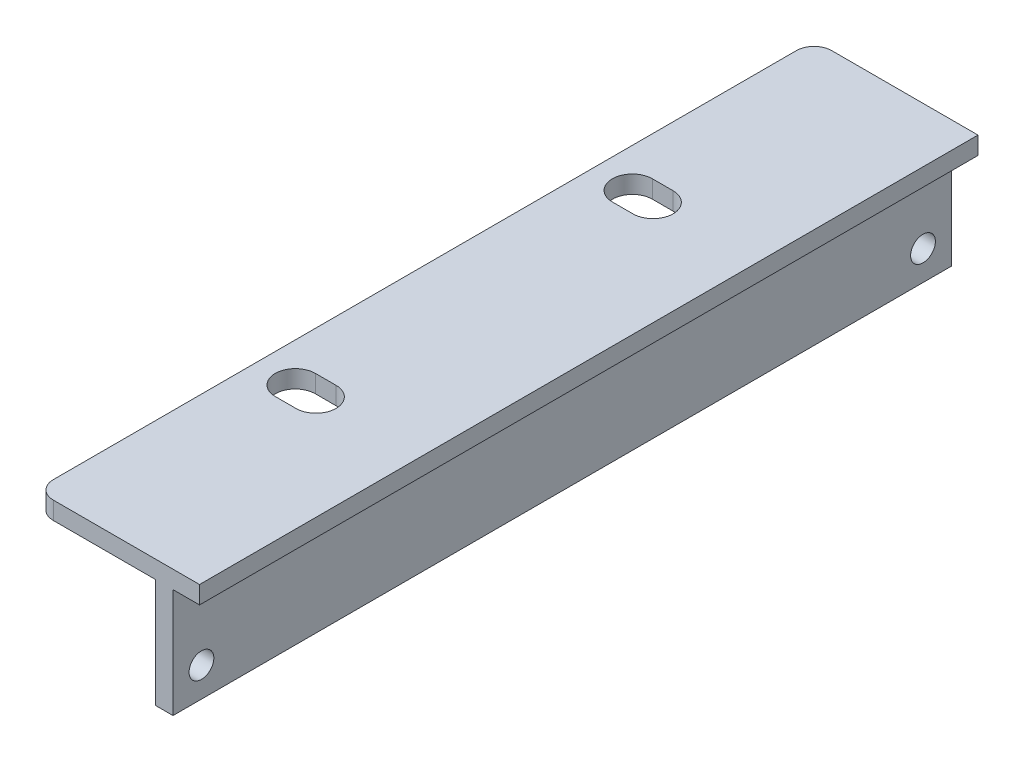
ISO-10303-21;
HEADER;
FILE_DESCRIPTION(('STEP AP214'),'2;1');
FILE_NAME('part.step','',(''),(''),'','','');
FILE_SCHEMA(('AUTOMOTIVE_DESIGN { 1 0 10303 214 1 1 1 1 }'));
ENDSEC;
DATA;
#1=APPLICATION_CONTEXT('core data for automotive mechanical design processes');
#2=APPLICATION_PROTOCOL_DEFINITION('international standard','automotive_design',2000,#1);
#3=PRODUCT_CONTEXT('',#1,'mechanical');
#4=PRODUCT('Part','Part','',(#3));
#5=PRODUCT_RELATED_PRODUCT_CATEGORY('part','',(#4));
#6=PRODUCT_DEFINITION_FORMATION('','',#4);
#7=PRODUCT_DEFINITION_CONTEXT('part definition',#1,'design');
#8=PRODUCT_DEFINITION('design','',#6,#7);
#9=PRODUCT_DEFINITION_SHAPE('','',#8);
#10=(LENGTH_UNIT() NAMED_UNIT(*) SI_UNIT(.MILLI.,.METRE.));
#11=(NAMED_UNIT(*) PLANE_ANGLE_UNIT() SI_UNIT($,.RADIAN.));
#12=(NAMED_UNIT(*) SI_UNIT($,.STERADIAN.) SOLID_ANGLE_UNIT());
#13=UNCERTAINTY_MEASURE_WITH_UNIT(LENGTH_MEASURE(1.E-05),#10,'distance_accuracy_value','');
#14=(GEOMETRIC_REPRESENTATION_CONTEXT(3) GLOBAL_UNCERTAINTY_ASSIGNED_CONTEXT((#13)) GLOBAL_UNIT_ASSIGNED_CONTEXT((#10,
#11,#12)) REPRESENTATION_CONTEXT('',''));
#15=CARTESIAN_POINT('',(0.,0.,0.));
#16=DIRECTION('',(0.,0.,1.));
#17=DIRECTION('',(1.,0.,0.));
#18=AXIS2_PLACEMENT_3D('',#15,#16,#17);
#19=CARTESIAN_POINT('',(0.00100000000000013,-16.5,-4.825));
#20=DIRECTION('',(-1.,0.,0.));
#21=DIRECTION('',(0.,0.,1.));
#22=AXIS2_PLACEMENT_3D('',#19,#20,#21);
#23=CYLINDRICAL_SURFACE('',#22,2.1);
#24=CARTESIAN_POINT('',(-7.50000000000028,-16.5,-4.825));
#25=DIRECTION('',(-1.,0.,0.));
#26=DIRECTION('',(0.,0.,1.));
#27=AXIS2_PLACEMENT_3D('',#24,#25,#26);
#28=CIRCLE('',#27,2.1);
#29=CARTESIAN_POINT('',(-7.50000000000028,-16.5,-2.72499999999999));
#30=VERTEX_POINT('',#29);
#31=EDGE_CURVE('E205',#30,#30,#28,.F.);
#32=ORIENTED_EDGE('',*,*,#31,.F.);
#33=EDGE_LOOP('',(#32));
#34=FACE_BOUND('',#33,.T.);
#35=CARTESIAN_POINT('',(-4.50000000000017,-16.5,-4.825));
#36=DIRECTION('',(-1.,0.,0.));
#37=DIRECTION('',(0.,0.,1.));
#38=AXIS2_PLACEMENT_3D('',#35,#36,#37);
#39=CIRCLE('',#38,2.1);
#40=CARTESIAN_POINT('',(-4.50000000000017,-16.5,-2.72499999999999));
#41=VERTEX_POINT('',#40);
#42=EDGE_CURVE('E19',#41,#41,#39,.T.);
#43=ORIENTED_EDGE('',*,*,#42,.F.);
#44=EDGE_LOOP('',(#43));
#45=FACE_BOUND('',#44,.T.);
#46=ADVANCED_FACE('F16',(#34,#45),#23,.F.);
#47=CARTESIAN_POINT('',(0.00100000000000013,-16.5,-127.175));
#48=DIRECTION('',(-1.,0.,0.));
#49=DIRECTION('',(0.,0.,1.));
#50=AXIS2_PLACEMENT_3D('',#47,#48,#49);
#51=CYLINDRICAL_SURFACE('',#50,2.09999999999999);
#52=CARTESIAN_POINT('',(-7.50000000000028,-16.5,-127.175));
#53=DIRECTION('',(-1.,0.,0.));
#54=DIRECTION('',(0.,0.,1.));
#55=AXIS2_PLACEMENT_3D('',#52,#53,#54);
#56=CIRCLE('',#55,2.09999999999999);
#57=CARTESIAN_POINT('',(-7.50000000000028,-16.5,-125.075));
#58=VERTEX_POINT('',#57);
#59=EDGE_CURVE('E195',#58,#58,#56,.F.);
#60=ORIENTED_EDGE('',*,*,#59,.F.);
#61=EDGE_LOOP('',(#60));
#62=FACE_BOUND('',#61,.T.);
#63=CARTESIAN_POINT('',(-4.50000000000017,-16.5,-127.175));
#64=DIRECTION('',(-1.,0.,0.));
#65=DIRECTION('',(0.,0.,1.));
#66=AXIS2_PLACEMENT_3D('',#63,#64,#65);
#67=CIRCLE('',#66,2.09999999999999);
#68=CARTESIAN_POINT('',(-4.50000000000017,-16.5,-125.075));
#69=VERTEX_POINT('',#68);
#70=EDGE_CURVE('E215',#69,#69,#67,.T.);
#71=ORIENTED_EDGE('',*,*,#70,.F.);
#72=EDGE_LOOP('',(#71));
#73=FACE_BOUND('',#72,.T.);
#74=ADVANCED_FACE('F277',(#62,#73),#51,.F.);
#75=CARTESIAN_POINT('',(-4.50000000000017,-2.99999999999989,-132.));
#76=DIRECTION('',(0.,-1.,0.));
#77=DIRECTION('',(0.,0.,-1.));
#78=AXIS2_PLACEMENT_3D('',#75,#76,#77);
#79=PLANE('',#78);
#80=DIRECTION('',(-1.,0.,0.));
#81=VECTOR('',#80,1.);
#82=CARTESIAN_POINT('',(0.,-2.99999999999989,-132.));
#83=LINE('',#82,#81);
#84=CARTESIAN_POINT('',(0.,-2.99999999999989,-132.));
#85=VERTEX_POINT('',#84);
#86=CARTESIAN_POINT('',(-4.50000000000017,-2.99999999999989,-132.));
#87=VERTEX_POINT('',#86);
#88=EDGE_CURVE('E158',#85,#87,#83,.T.);
#89=ORIENTED_EDGE('',*,*,#88,.F.);
#90=DIRECTION('',(0.,0.,-1.));
#91=VECTOR('',#90,1.);
#92=CARTESIAN_POINT('',(0.,-2.99999999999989,-132.));
#93=LINE('',#92,#91);
#94=CARTESIAN_POINT('',(0.,-2.99999999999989,0.));
#95=VERTEX_POINT('',#94);
#96=EDGE_CURVE('E150',#95,#85,#93,.T.);
#97=ORIENTED_EDGE('',*,*,#96,.F.);
#98=DIRECTION('',(-1.,0.,0.));
#99=VECTOR('',#98,1.);
#100=CARTESIAN_POINT('',(0.,-2.99999999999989,0.));
#101=LINE('',#100,#99);
#102=CARTESIAN_POINT('',(-4.50000000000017,-2.99999999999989,0.));
#103=VERTEX_POINT('',#102);
#104=EDGE_CURVE('E175',#95,#103,#101,.T.);
#105=ORIENTED_EDGE('',*,*,#104,.T.);
#106=DIRECTION('',(0.,0.,-1.));
#107=VECTOR('',#106,1.);
#108=CARTESIAN_POINT('',(-4.50000000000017,-2.99999999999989,-132.));
#109=LINE('',#108,#107);
#110=EDGE_CURVE('E206',#87,#103,#109,.F.);
#111=ORIENTED_EDGE('',*,*,#110,.F.);
#112=EDGE_LOOP('',(#89,#97,#105,#111));
#113=FACE_BOUND('',#112,.T.);
#114=ADVANCED_FACE('F283',(#113),#79,.T.);
#115=CARTESIAN_POINT('',(-4.50000000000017,-2.99999999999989,-132.));
#116=DIRECTION('',(1.,0.,0.));
#117=DIRECTION('',(0.,0.,-1.));
#118=AXIS2_PLACEMENT_3D('',#115,#116,#117);
#119=PLANE('',#118);
#120=DIRECTION('',(0.,1.,0.));
#121=VECTOR('',#120,1.);
#122=CARTESIAN_POINT('',(-4.50000000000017,0.,-132.));
#123=LINE('',#122,#121);
#124=CARTESIAN_POINT('',(-4.50000000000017,-21.4999999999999,-132.));
#125=VERTEX_POINT('',#124);
#126=EDGE_CURVE('E161',#87,#125,#123,.F.);
#127=ORIENTED_EDGE('',*,*,#126,.F.);
#128=ORIENTED_EDGE('',*,*,#110,.T.);
#129=DIRECTION('',(0.,1.,0.));
#130=VECTOR('',#129,1.);
#131=CARTESIAN_POINT('',(-4.50000000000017,0.,0.));
#132=LINE('',#131,#130);
#133=CARTESIAN_POINT('',(-4.50000000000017,-21.4999999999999,0.));
#134=VERTEX_POINT('',#133);
#135=EDGE_CURVE('E178',#103,#134,#132,.F.);
#136=ORIENTED_EDGE('',*,*,#135,.T.);
#137=DIRECTION('',(0.,0.,-1.));
#138=VECTOR('',#137,1.);
#139=CARTESIAN_POINT('',(-4.50000000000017,-21.4999999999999,-132.));
#140=LINE('',#139,#138);
#141=EDGE_CURVE('E202',#125,#134,#140,.F.);
#142=ORIENTED_EDGE('',*,*,#141,.F.);
#143=EDGE_LOOP('',(#127,#128,#136,#142));
#144=FACE_BOUND('',#143,.T.);
#145=ORIENTED_EDGE('',*,*,#70,.T.);
#146=EDGE_LOOP('',(#145));
#147=FACE_BOUND('',#146,.T.);
#148=ORIENTED_EDGE('',*,*,#42,.T.);
#149=EDGE_LOOP('',(#148));
#150=FACE_BOUND('',#149,.T.);
#151=ADVANCED_FACE('F274',(#144,#147,#150),#119,.T.);
#152=CARTESIAN_POINT('',(-7.50000000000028,-21.4999999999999,-132.));
#153=DIRECTION('',(0.,-1.,0.));
#154=DIRECTION('',(0.,0.,-1.));
#155=AXIS2_PLACEMENT_3D('',#152,#153,#154);
#156=PLANE('',#155);
#157=DIRECTION('',(-1.,0.,0.));
#158=VECTOR('',#157,1.);
#159=CARTESIAN_POINT('',(0.,-21.4999999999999,-132.));
#160=LINE('',#159,#158);
#161=CARTESIAN_POINT('',(-7.50000000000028,-21.4999999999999,-132.));
#162=VERTEX_POINT('',#161);
#163=EDGE_CURVE('E172',#125,#162,#160,.T.);
#164=ORIENTED_EDGE('',*,*,#163,.F.);
#165=ORIENTED_EDGE('',*,*,#141,.T.);
#166=DIRECTION('',(-1.,0.,0.));
#167=VECTOR('',#166,1.);
#168=CARTESIAN_POINT('',(0.,-21.4999999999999,0.));
#169=LINE('',#168,#167);
#170=CARTESIAN_POINT('',(-7.50000000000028,-21.4999999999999,0.));
#171=VERTEX_POINT('',#170);
#172=EDGE_CURVE('E190',#134,#171,#169,.T.);
#173=ORIENTED_EDGE('',*,*,#172,.T.);
#174=DIRECTION('',(0.,0.,1.));
#175=VECTOR('',#174,1.);
#176=CARTESIAN_POINT('',(-7.50000000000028,-21.4999999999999,-132.));
#177=LINE('',#176,#175);
#178=EDGE_CURVE('E166',#162,#171,#177,.T.);
#179=ORIENTED_EDGE('',*,*,#178,.F.);
#180=EDGE_LOOP('',(#164,#165,#173,#179));
#181=FACE_BOUND('',#180,.T.);
#182=ADVANCED_FACE('F352',(#181),#156,.T.);
#183=CARTESIAN_POINT('',(-7.50000000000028,-2.99999999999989,-132.));
#184=DIRECTION('',(-1.,0.,0.));
#185=DIRECTION('',(0.,0.,1.));
#186=AXIS2_PLACEMENT_3D('',#183,#184,#185);
#187=PLANE('',#186);
#188=DIRECTION('',(0.,1.,0.));
#189=VECTOR('',#188,1.);
#190=CARTESIAN_POINT('',(-7.50000000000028,0.,-132.));
#191=LINE('',#190,#189);
#192=CARTESIAN_POINT('',(-7.50000000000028,-2.99999999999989,-132.));
#193=VERTEX_POINT('',#192);
#194=EDGE_CURVE('E169',#162,#193,#191,.T.);
#195=ORIENTED_EDGE('',*,*,#194,.F.);
#196=ORIENTED_EDGE('',*,*,#178,.T.);
#197=DIRECTION('',(0.,1.,0.));
#198=VECTOR('',#197,1.);
#199=CARTESIAN_POINT('',(-7.50000000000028,0.,0.));
#200=LINE('',#199,#198);
#201=CARTESIAN_POINT('',(-7.50000000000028,-2.99999999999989,0.));
#202=VERTEX_POINT('',#201);
#203=EDGE_CURVE('E185',#171,#202,#200,.T.);
#204=ORIENTED_EDGE('',*,*,#203,.T.);
#205=DIRECTION('',(0.,0.,-1.));
#206=VECTOR('',#205,1.);
#207=CARTESIAN_POINT('',(-7.50000000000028,-2.99999999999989,-132.));
#208=LINE('',#207,#206);
#209=EDGE_CURVE('E131',#193,#202,#208,.F.);
#210=ORIENTED_EDGE('',*,*,#209,.F.);
#211=EDGE_LOOP('',(#195,#196,#204,#210));
#212=FACE_BOUND('',#211,.T.);
#213=ORIENTED_EDGE('',*,*,#59,.T.);
#214=EDGE_LOOP('',(#213));
#215=FACE_BOUND('',#214,.T.);
#216=ORIENTED_EDGE('',*,*,#31,.T.);
#217=EDGE_LOOP('',(#216));
#218=FACE_BOUND('',#217,.T.);
#219=ADVANCED_FACE('F348',(#212,#215,#218),#187,.T.);
#220=CARTESIAN_POINT('',(-27.8,-2.99999999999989,-132.));
#221=DIRECTION('',(0.,-1.,0.));
#222=DIRECTION('',(0.,0.,-1.));
#223=AXIS2_PLACEMENT_3D('',#220,#221,#222);
#224=PLANE('',#223);
#225=DIRECTION('',(-1.,0.,0.));
#226=VECTOR('',#225,1.);
#227=CARTESIAN_POINT('',(0.,-2.99999999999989,-132.));
#228=LINE('',#227,#226);
#229=CARTESIAN_POINT('',(-24.8,-2.99999999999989,-132.));
#230=VERTEX_POINT('',#229);
#231=EDGE_CURVE('E147',#193,#230,#228,.T.);
#232=ORIENTED_EDGE('',*,*,#231,.F.);
#233=ORIENTED_EDGE('',*,*,#209,.T.);
#234=DIRECTION('',(-1.,0.,0.));
#235=VECTOR('',#234,1.);
#236=CARTESIAN_POINT('',(0.,-2.99999999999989,0.));
#237=LINE('',#236,#235);
#238=CARTESIAN_POINT('',(-24.8,-2.99999999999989,0.));
#239=VERTEX_POINT('',#238);
#240=EDGE_CURVE('E182',#202,#239,#237,.T.);
#241=ORIENTED_EDGE('',*,*,#240,.T.);
#242=CARTESIAN_POINT('',(-24.8,-2.99999999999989,-3.));
#243=DIRECTION('',(0.,1.,0.));
#244=DIRECTION('',(0.,0.,1.));
#245=AXIS2_PLACEMENT_3D('',#242,#243,#244);
#246=CIRCLE('',#245,3.);
#247=CARTESIAN_POINT('',(-27.8,-2.99999999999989,-3.));
#248=VERTEX_POINT('',#247);
#249=EDGE_CURVE('E179',#248,#239,#246,.T.);
#250=ORIENTED_EDGE('',*,*,#249,.F.);
#251=DIRECTION('',(0.,0.,1.));
#252=VECTOR('',#251,1.);
#253=CARTESIAN_POINT('',(-27.8,-2.99999999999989,-132.));
#254=LINE('',#253,#252);
#255=CARTESIAN_POINT('',(-27.8,-2.99999999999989,-129.));
#256=VERTEX_POINT('',#255);
#257=EDGE_CURVE('E143',#256,#248,#254,.T.);
#258=ORIENTED_EDGE('',*,*,#257,.F.);
#259=CARTESIAN_POINT('',(-24.8,-2.99999999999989,-129.));
#260=DIRECTION('',(0.,-1.,0.));
#261=DIRECTION('',(0.,0.,-1.));
#262=AXIS2_PLACEMENT_3D('',#259,#260,#261);
#263=CIRCLE('',#262,3.);
#264=EDGE_CURVE('E257',#230,#256,#263,.F.);
#265=ORIENTED_EDGE('',*,*,#264,.F.);
#266=EDGE_LOOP('',(#232,#233,#241,#250,#258,#265));
#267=FACE_BOUND('',#266,.T.);
#268=CARTESIAN_POINT('',(-17.6800000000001,-2.99999999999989,-94.575));
#269=DIRECTION('',(0.,1.,0.));
#270=DIRECTION('',(0.,0.,1.));
#271=AXIS2_PLACEMENT_3D('',#268,#269,#270);
#272=CIRCLE('',#271,3.4);
#273=CARTESIAN_POINT('',(-17.6800000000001,-2.99999999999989,-91.175));
#274=VERTEX_POINT('',#273);
#275=CARTESIAN_POINT('',(-17.6800000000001,-2.99999999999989,-97.975));
#276=VERTEX_POINT('',#275);
#277=EDGE_CURVE('E262',#274,#276,#272,.T.);
#278=ORIENTED_EDGE('',*,*,#277,.T.);
#279=DIRECTION('',(-1.,0.,0.));
#280=VECTOR('',#279,1.);
#281=CARTESIAN_POINT('',(-21.1800000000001,-2.99999999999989,-97.975));
#282=LINE('',#281,#280);
#283=CARTESIAN_POINT('',(-21.1800000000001,-2.99999999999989,-97.975));
#284=VERTEX_POINT('',#283);
#285=EDGE_CURVE('E222',#276,#284,#282,.T.);
#286=ORIENTED_EDGE('',*,*,#285,.T.);
#287=CARTESIAN_POINT('',(-21.1800000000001,-2.99999999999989,-94.575));
#288=DIRECTION('',(0.,1.,0.));
#289=DIRECTION('',(0.,0.,1.));
#290=AXIS2_PLACEMENT_3D('',#287,#288,#289);
#291=CIRCLE('',#290,3.4);
#292=CARTESIAN_POINT('',(-21.1800000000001,-2.99999999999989,-91.175));
#293=VERTEX_POINT('',#292);
#294=EDGE_CURVE('E225',#284,#293,#291,.T.);
#295=ORIENTED_EDGE('',*,*,#294,.T.);
#296=DIRECTION('',(1.,0.,0.));
#297=VECTOR('',#296,1.);
#298=CARTESIAN_POINT('',(-21.1800000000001,-2.99999999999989,-91.175));
#299=LINE('',#298,#297);
#300=EDGE_CURVE('E218',#293,#274,#299,.T.);
#301=ORIENTED_EDGE('',*,*,#300,.T.);
#302=EDGE_LOOP('',(#278,#286,#295,#301));
#303=FACE_BOUND('',#302,.T.);
#304=CARTESIAN_POINT('',(-21.1800000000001,-2.99999999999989,-37.425));
#305=DIRECTION('',(0.,1.,0.));
#306=DIRECTION('',(0.,0.,1.));
#307=AXIS2_PLACEMENT_3D('',#304,#305,#306);
#308=CIRCLE('',#307,3.4);
#309=CARTESIAN_POINT('',(-21.1800000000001,-2.99999999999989,-40.825));
#310=VERTEX_POINT('',#309);
#311=CARTESIAN_POINT('',(-21.1800000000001,-2.99999999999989,-34.025));
#312=VERTEX_POINT('',#311);
#313=EDGE_CURVE('E119',#310,#312,#308,.T.);
#314=ORIENTED_EDGE('',*,*,#313,.T.);
#315=DIRECTION('',(1.,0.,0.));
#316=VECTOR('',#315,1.);
#317=CARTESIAN_POINT('',(-21.1800000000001,-2.99999999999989,-34.025));
#318=LINE('',#317,#316);
#319=CARTESIAN_POINT('',(-17.6800000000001,-2.99999999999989,-34.025));
#320=VERTEX_POINT('',#319);
#321=EDGE_CURVE('E113',#312,#320,#318,.T.);
#322=ORIENTED_EDGE('',*,*,#321,.T.);
#323=CARTESIAN_POINT('',(-17.6800000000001,-2.99999999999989,-37.425));
#324=DIRECTION('',(0.,1.,0.));
#325=DIRECTION('',(0.,0.,1.));
#326=AXIS2_PLACEMENT_3D('',#323,#324,#325);
#327=CIRCLE('',#326,3.4);
#328=CARTESIAN_POINT('',(-17.6800000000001,-2.99999999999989,-40.825));
#329=VERTEX_POINT('',#328);
#330=EDGE_CURVE('E116',#320,#329,#327,.T.);
#331=ORIENTED_EDGE('',*,*,#330,.T.);
#332=DIRECTION('',(-1.,0.,0.));
#333=VECTOR('',#332,1.);
#334=CARTESIAN_POINT('',(-21.1800000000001,-2.99999999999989,-40.825));
#335=LINE('',#334,#333);
#336=EDGE_CURVE('E226',#329,#310,#335,.T.);
#337=ORIENTED_EDGE('',*,*,#336,.T.);
#338=EDGE_LOOP('',(#314,#322,#331,#337));
#339=FACE_BOUND('',#338,.T.);
#340=ADVANCED_FACE('F115',(#267,#303,#339),#224,.T.);
#341=CARTESIAN_POINT('',(-17.6800000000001,-21.5009999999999,-37.425));
#342=DIRECTION('',(0.,1.,0.));
#343=DIRECTION('',(0.,0.,1.));
#344=AXIS2_PLACEMENT_3D('',#341,#342,#343);
#345=CYLINDRICAL_SURFACE('',#344,3.4);
#346=CARTESIAN_POINT('',(-17.6800000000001,0.,-37.425));
#347=DIRECTION('',(0.,1.,0.));
#348=DIRECTION('',(0.,0.,1.));
#349=AXIS2_PLACEMENT_3D('',#346,#347,#348);
#350=CIRCLE('',#349,3.4);
#351=CARTESIAN_POINT('',(-17.6800000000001,0.,-40.825));
#352=VERTEX_POINT('',#351);
#353=CARTESIAN_POINT('',(-17.6800000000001,0.,-34.025));
#354=VERTEX_POINT('',#353);
#355=EDGE_CURVE('E254',#352,#354,#350,.F.);
#356=ORIENTED_EDGE('',*,*,#355,.F.);
#357=DIRECTION('',(0.,1.,0.));
#358=VECTOR('',#357,1.);
#359=CARTESIAN_POINT('',(-17.68,-21.5009999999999,-40.825));
#360=LINE('',#359,#358);
#361=EDGE_CURVE('E129',#352,#329,#360,.F.);
#362=ORIENTED_EDGE('',*,*,#361,.T.);
#363=ORIENTED_EDGE('',*,*,#330,.F.);
#364=DIRECTION('',(0.,1.,0.));
#365=VECTOR('',#364,1.);
#366=CARTESIAN_POINT('',(-17.6800000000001,-21.5009999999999,-34.025));
#367=LINE('',#366,#365);
#368=EDGE_CURVE('E123',#320,#354,#367,.T.);
#369=ORIENTED_EDGE('',*,*,#368,.T.);
#370=EDGE_LOOP('',(#356,#362,#363,#369));
#371=FACE_BOUND('',#370,.T.);
#372=ADVANCED_FACE('F126',(#371),#345,.F.);
#373=CARTESIAN_POINT('',(-21.1800000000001,-21.5009999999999,-34.025));
#374=DIRECTION('',(0.,0.,1.));
#375=DIRECTION('',(1.,0.,0.));
#376=AXIS2_PLACEMENT_3D('',#373,#374,#375);
#377=PLANE('',#376);
#378=DIRECTION('',(1.,0.,0.));
#379=VECTOR('',#378,1.);
#380=CARTESIAN_POINT('',(-27.8,0.,-34.025));
#381=LINE('',#380,#379);
#382=CARTESIAN_POINT('',(-21.1800000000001,0.,-34.025));
#383=VERTEX_POINT('',#382);
#384=EDGE_CURVE('E135',#354,#383,#381,.F.);
#385=ORIENTED_EDGE('',*,*,#384,.F.);
#386=ORIENTED_EDGE('',*,*,#368,.F.);
#387=ORIENTED_EDGE('',*,*,#321,.F.);
#388=DIRECTION('',(0.,1.,0.));
#389=VECTOR('',#388,1.);
#390=CARTESIAN_POINT('',(-21.1800000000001,-21.5009999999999,-34.025));
#391=LINE('',#390,#389);
#392=EDGE_CURVE('E138',#312,#383,#391,.T.);
#393=ORIENTED_EDGE('',*,*,#392,.T.);
#394=EDGE_LOOP('',(#385,#386,#387,#393));
#395=FACE_BOUND('',#394,.T.);
#396=ADVANCED_FACE('F133',(#395),#377,.F.);
#397=CARTESIAN_POINT('',(-21.1800000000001,-21.5009999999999,-37.425));
#398=DIRECTION('',(0.,1.,0.));
#399=DIRECTION('',(0.,0.,1.));
#400=AXIS2_PLACEMENT_3D('',#397,#398,#399);
#401=CYLINDRICAL_SURFACE('',#400,3.4);
#402=CARTESIAN_POINT('',(-21.1800000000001,0.,-37.425));
#403=DIRECTION('',(0.,1.,0.));
#404=DIRECTION('',(0.,0.,1.));
#405=AXIS2_PLACEMENT_3D('',#402,#403,#404);
#406=CIRCLE('',#405,3.4);
#407=CARTESIAN_POINT('',(-21.1800000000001,0.,-40.825));
#408=VERTEX_POINT('',#407);
#409=EDGE_CURVE('E251',#383,#408,#406,.F.);
#410=ORIENTED_EDGE('',*,*,#409,.F.);
#411=ORIENTED_EDGE('',*,*,#392,.F.);
#412=ORIENTED_EDGE('',*,*,#313,.F.);
#413=DIRECTION('',(0.,1.,0.));
#414=VECTOR('',#413,1.);
#415=CARTESIAN_POINT('',(-21.1800000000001,-21.5009999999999,-40.825));
#416=LINE('',#415,#414);
#417=EDGE_CURVE('E227',#310,#408,#416,.T.);
#418=ORIENTED_EDGE('',*,*,#417,.T.);
#419=EDGE_LOOP('',(#410,#411,#412,#418));
#420=FACE_BOUND('',#419,.T.);
#421=ADVANCED_FACE('F337',(#420),#401,.F.);
#422=CARTESIAN_POINT('',(-21.1800000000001,-21.5009999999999,-40.825));
#423=DIRECTION('',(0.,0.,-1.));
#424=DIRECTION('',(-1.,0.,0.));
#425=AXIS2_PLACEMENT_3D('',#422,#423,#424);
#426=PLANE('',#425);
#427=DIRECTION('',(1.,0.,0.));
#428=VECTOR('',#427,1.);
#429=CARTESIAN_POINT('',(-27.8,0.,-40.825));
#430=LINE('',#429,#428);
#431=EDGE_CURVE('E250',#408,#352,#430,.T.);
#432=ORIENTED_EDGE('',*,*,#431,.F.);
#433=ORIENTED_EDGE('',*,*,#417,.F.);
#434=ORIENTED_EDGE('',*,*,#336,.F.);
#435=ORIENTED_EDGE('',*,*,#361,.F.);
#436=EDGE_LOOP('',(#432,#433,#434,#435));
#437=FACE_BOUND('',#436,.T.);
#438=ADVANCED_FACE('F333',(#437),#426,.F.);
#439=CARTESIAN_POINT('',(-21.1800000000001,-21.5009999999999,-94.575));
#440=DIRECTION('',(0.,1.,0.));
#441=DIRECTION('',(0.,0.,1.));
#442=AXIS2_PLACEMENT_3D('',#439,#440,#441);
#443=CYLINDRICAL_SURFACE('',#442,3.4);
#444=CARTESIAN_POINT('',(-21.1800000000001,0.,-94.575));
#445=DIRECTION('',(0.,1.,0.));
#446=DIRECTION('',(0.,0.,1.));
#447=AXIS2_PLACEMENT_3D('',#444,#445,#446);
#448=CIRCLE('',#447,3.4);
#449=CARTESIAN_POINT('',(-21.1800000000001,0.,-91.175));
#450=VERTEX_POINT('',#449);
#451=CARTESIAN_POINT('',(-21.1800000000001,0.,-97.975));
#452=VERTEX_POINT('',#451);
#453=EDGE_CURVE('E247',#450,#452,#448,.F.);
#454=ORIENTED_EDGE('',*,*,#453,.F.);
#455=DIRECTION('',(0.,1.,0.));
#456=VECTOR('',#455,1.);
#457=CARTESIAN_POINT('',(-21.1800000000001,-21.5009999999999,-91.175));
#458=LINE('',#457,#456);
#459=EDGE_CURVE('E146',#450,#293,#458,.F.);
#460=ORIENTED_EDGE('',*,*,#459,.T.);
#461=ORIENTED_EDGE('',*,*,#294,.F.);
#462=DIRECTION('',(0.,1.,0.));
#463=VECTOR('',#462,1.);
#464=CARTESIAN_POINT('',(-21.1800000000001,-21.5009999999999,-97.975));
#465=LINE('',#464,#463);
#466=EDGE_CURVE('E224',#284,#452,#465,.T.);
#467=ORIENTED_EDGE('',*,*,#466,.T.);
#468=EDGE_LOOP('',(#454,#460,#461,#467));
#469=FACE_BOUND('',#468,.T.);
#470=ADVANCED_FACE('F329',(#469),#443,.F.);
#471=CARTESIAN_POINT('',(-21.1800000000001,-21.5009999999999,-97.975));
#472=DIRECTION('',(0.,0.,-1.));
#473=DIRECTION('',(-1.,0.,0.));
#474=AXIS2_PLACEMENT_3D('',#471,#472,#473);
#475=PLANE('',#474);
#476=DIRECTION('',(1.,0.,0.));
#477=VECTOR('',#476,1.);
#478=CARTESIAN_POINT('',(-27.8,0.,-97.975));
#479=LINE('',#478,#477);
#480=CARTESIAN_POINT('',(-17.6800000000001,0.,-97.975));
#481=VERTEX_POINT('',#480);
#482=EDGE_CURVE('E246',#452,#481,#479,.T.);
#483=ORIENTED_EDGE('',*,*,#482,.F.);
#484=ORIENTED_EDGE('',*,*,#466,.F.);
#485=ORIENTED_EDGE('',*,*,#285,.F.);
#486=DIRECTION('',(0.,1.,0.));
#487=VECTOR('',#486,1.);
#488=CARTESIAN_POINT('',(-17.6800000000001,-21.5009999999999,-97.975));
#489=LINE('',#488,#487);
#490=EDGE_CURVE('E221',#276,#481,#489,.T.);
#491=ORIENTED_EDGE('',*,*,#490,.T.);
#492=EDGE_LOOP('',(#483,#484,#485,#491));
#493=FACE_BOUND('',#492,.T.);
#494=ADVANCED_FACE('F325',(#493),#475,.F.);
#495=CARTESIAN_POINT('',(-17.6800000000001,-21.5009999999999,-94.575));
#496=DIRECTION('',(0.,1.,0.));
#497=DIRECTION('',(0.,0.,1.));
#498=AXIS2_PLACEMENT_3D('',#495,#496,#497);
#499=CYLINDRICAL_SURFACE('',#498,3.4);
#500=CARTESIAN_POINT('',(-17.6800000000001,0.,-94.575));
#501=DIRECTION('',(0.,1.,0.));
#502=DIRECTION('',(0.,0.,1.));
#503=AXIS2_PLACEMENT_3D('',#500,#501,#502);
#504=CIRCLE('',#503,3.4);
#505=CARTESIAN_POINT('',(-17.6800000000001,0.,-91.175));
#506=VERTEX_POINT('',#505);
#507=EDGE_CURVE('E242',#481,#506,#504,.F.);
#508=ORIENTED_EDGE('',*,*,#507,.F.);
#509=ORIENTED_EDGE('',*,*,#490,.F.);
#510=ORIENTED_EDGE('',*,*,#277,.F.);
#511=DIRECTION('',(0.,1.,0.));
#512=VECTOR('',#511,1.);
#513=CARTESIAN_POINT('',(-17.68,-21.5009999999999,-91.175));
#514=LINE('',#513,#512);
#515=EDGE_CURVE('E220',#274,#506,#514,.T.);
#516=ORIENTED_EDGE('',*,*,#515,.T.);
#517=EDGE_LOOP('',(#508,#509,#510,#516));
#518=FACE_BOUND('',#517,.T.);
#519=ADVANCED_FACE('F321',(#518),#499,.F.);
#520=CARTESIAN_POINT('',(-21.1800000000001,-21.5009999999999,-91.175));
#521=DIRECTION('',(0.,0.,1.));
#522=DIRECTION('',(1.,0.,0.));
#523=AXIS2_PLACEMENT_3D('',#520,#521,#522);
#524=PLANE('',#523);
#525=DIRECTION('',(1.,0.,0.));
#526=VECTOR('',#525,1.);
#527=CARTESIAN_POINT('',(-27.8,0.,-91.175));
#528=LINE('',#527,#526);
#529=EDGE_CURVE('E245',#506,#450,#528,.F.);
#530=ORIENTED_EDGE('',*,*,#529,.F.);
#531=ORIENTED_EDGE('',*,*,#515,.F.);
#532=ORIENTED_EDGE('',*,*,#300,.F.);
#533=ORIENTED_EDGE('',*,*,#459,.F.);
#534=EDGE_LOOP('',(#530,#531,#532,#533));
#535=FACE_BOUND('',#534,.T.);
#536=ADVANCED_FACE('F317',(#535),#524,.F.);
#537=CARTESIAN_POINT('',(-27.8,0.,-132.));
#538=DIRECTION('',(-1.,0.,0.));
#539=DIRECTION('',(0.,0.,1.));
#540=AXIS2_PLACEMENT_3D('',#537,#538,#539);
#541=PLANE('',#540);
#542=DIRECTION('',(0.,0.,1.));
#543=VECTOR('',#542,1.);
#544=CARTESIAN_POINT('',(-27.8,0.,-132.));
#545=LINE('',#544,#543);
#546=CARTESIAN_POINT('',(-27.8,0.,-129.));
#547=VERTEX_POINT('',#546);
#548=CARTESIAN_POINT('',(-27.8,0.,-3.));
#549=VERTEX_POINT('',#548);
#550=EDGE_CURVE('E241',#547,#549,#545,.T.);
#551=ORIENTED_EDGE('',*,*,#550,.F.);
#552=DIRECTION('',(0.,-1.,0.));
#553=VECTOR('',#552,1.);
#554=CARTESIAN_POINT('',(-27.8000000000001,0.,-129.));
#555=LINE('',#554,#553);
#556=EDGE_CURVE('E256',#256,#547,#555,.F.);
#557=ORIENTED_EDGE('',*,*,#556,.F.);
#558=ORIENTED_EDGE('',*,*,#257,.T.);
#559=DIRECTION('',(0.,1.,0.));
#560=VECTOR('',#559,1.);
#561=CARTESIAN_POINT('',(-27.8,0.,-3.));
#562=LINE('',#561,#560);
#563=EDGE_CURVE('E145',#549,#248,#562,.F.);
#564=ORIENTED_EDGE('',*,*,#563,.F.);
#565=EDGE_LOOP('',(#551,#557,#558,#564));
#566=FACE_BOUND('',#565,.T.);
#567=ADVANCED_FACE('F313',(#566),#541,.T.);
#568=CARTESIAN_POINT('',(-24.8,0.,-3.));
#569=DIRECTION('',(0.,1.,0.));
#570=DIRECTION('',(0.,0.,1.));
#571=AXIS2_PLACEMENT_3D('',#568,#569,#570);
#572=CYLINDRICAL_SURFACE('',#571,3.);
#573=ORIENTED_EDGE('',*,*,#249,.T.);
#574=DIRECTION('',(0.,1.,0.));
#575=VECTOR('',#574,1.);
#576=CARTESIAN_POINT('',(-24.8,0.,0.));
#577=LINE('',#576,#575);
#578=CARTESIAN_POINT('',(-24.8,0.,0.));
#579=VERTEX_POINT('',#578);
#580=EDGE_CURVE('E184',#239,#579,#577,.T.);
#581=ORIENTED_EDGE('',*,*,#580,.T.);
#582=CARTESIAN_POINT('',(-24.8,0.,-3.));
#583=DIRECTION('',(0.,1.,0.));
#584=DIRECTION('',(0.,0.,1.));
#585=AXIS2_PLACEMENT_3D('',#582,#583,#584);
#586=CIRCLE('',#585,3.);
#587=EDGE_CURVE('E237',#549,#579,#586,.T.);
#588=ORIENTED_EDGE('',*,*,#587,.F.);
#589=ORIENTED_EDGE('',*,*,#563,.T.);
#590=EDGE_LOOP('',(#573,#581,#588,#589));
#591=FACE_BOUND('',#590,.T.);
#592=ADVANCED_FACE('F309',(#591),#572,.T.);
#593=CARTESIAN_POINT('',(0.,0.,0.));
#594=DIRECTION('',(0.,0.,-1.));
#595=DIRECTION('',(-1.,0.,0.));
#596=AXIS2_PLACEMENT_3D('',#593,#594,#595);
#597=PLANE('',#596);
#598=ORIENTED_EDGE('',*,*,#580,.F.);
#599=ORIENTED_EDGE('',*,*,#240,.F.);
#600=ORIENTED_EDGE('',*,*,#203,.F.);
#601=ORIENTED_EDGE('',*,*,#172,.F.);
#602=ORIENTED_EDGE('',*,*,#135,.F.);
#603=ORIENTED_EDGE('',*,*,#104,.F.);
#604=DIRECTION('',(0.,1.,0.));
#605=VECTOR('',#604,1.);
#606=CARTESIAN_POINT('',(0.,0.,0.));
#607=LINE('',#606,#605);
#608=CARTESIAN_POINT('',(0.,0.,0.));
#609=VERTEX_POINT('',#608);
#610=EDGE_CURVE('E155',#609,#95,#607,.F.);
#611=ORIENTED_EDGE('',*,*,#610,.F.);
#612=DIRECTION('',(1.,0.,0.));
#613=VECTOR('',#612,1.);
#614=CARTESIAN_POINT('',(-27.8,0.,0.));
#615=LINE('',#614,#613);
#616=EDGE_CURVE('E240',#579,#609,#615,.T.);
#617=ORIENTED_EDGE('',*,*,#616,.F.);
#618=EDGE_LOOP('',(#598,#599,#600,#601,#602,#603,#611,#617));
#619=FACE_BOUND('',#618,.T.);
#620=ADVANCED_FACE('F305',(#619),#597,.F.);
#621=CARTESIAN_POINT('',(0.,0.,-132.));
#622=DIRECTION('',(1.,0.,0.));
#623=DIRECTION('',(0.,0.,-1.));
#624=AXIS2_PLACEMENT_3D('',#621,#622,#623);
#625=PLANE('',#624);
#626=DIRECTION('',(0.,1.,0.));
#627=VECTOR('',#626,1.);
#628=CARTESIAN_POINT('',(0.,0.,-132.));
#629=LINE('',#628,#627);
#630=CARTESIAN_POINT('',(0.,0.,-132.));
#631=VERTEX_POINT('',#630);
#632=EDGE_CURVE('E149',#631,#85,#629,.F.);
#633=ORIENTED_EDGE('',*,*,#632,.F.);
#634=DIRECTION('',(0.,0.,1.));
#635=VECTOR('',#634,1.);
#636=CARTESIAN_POINT('',(0.,0.,-132.));
#637=LINE('',#636,#635);
#638=EDGE_CURVE('E381',#609,#631,#637,.F.);
#639=ORIENTED_EDGE('',*,*,#638,.F.);
#640=ORIENTED_EDGE('',*,*,#610,.T.);
#641=ORIENTED_EDGE('',*,*,#96,.T.);
#642=EDGE_LOOP('',(#633,#639,#640,#641));
#643=FACE_BOUND('',#642,.T.);
#644=ADVANCED_FACE('F302',(#643),#625,.T.);
#645=CARTESIAN_POINT('',(0.,0.,-132.));
#646=DIRECTION('',(0.,0.,-1.));
#647=DIRECTION('',(-1.,0.,0.));
#648=AXIS2_PLACEMENT_3D('',#645,#646,#647);
#649=PLANE('',#648);
#650=ORIENTED_EDGE('',*,*,#163,.T.);
#651=ORIENTED_EDGE('',*,*,#194,.T.);
#652=ORIENTED_EDGE('',*,*,#231,.T.);
#653=DIRECTION('',(0.,-1.,0.));
#654=VECTOR('',#653,1.);
#655=CARTESIAN_POINT('',(-24.8,0.,-132.));
#656=LINE('',#655,#654);
#657=CARTESIAN_POINT('',(-24.8,0.,-132.));
#658=VERTEX_POINT('',#657);
#659=EDGE_CURVE('E34',#658,#230,#656,.T.);
#660=ORIENTED_EDGE('',*,*,#659,.F.);
#661=DIRECTION('',(1.,0.,0.));
#662=VECTOR('',#661,1.);
#663=CARTESIAN_POINT('',(-27.8,0.,-132.));
#664=LINE('',#663,#662);
#665=EDGE_CURVE('E25',#631,#658,#664,.F.);
#666=ORIENTED_EDGE('',*,*,#665,.F.);
#667=ORIENTED_EDGE('',*,*,#632,.T.);
#668=ORIENTED_EDGE('',*,*,#88,.T.);
#669=ORIENTED_EDGE('',*,*,#126,.T.);
#670=EDGE_LOOP('',(#650,#651,#652,#660,#666,#667,#668,#669));
#671=FACE_BOUND('',#670,.T.);
#672=ADVANCED_FACE('F294',(#671),#649,.T.);
#673=CARTESIAN_POINT('',(-24.8,0.,-129.));
#674=DIRECTION('',(0.,-1.,0.));
#675=DIRECTION('',(0.,0.,-1.));
#676=AXIS2_PLACEMENT_3D('',#673,#674,#675);
#677=CYLINDRICAL_SURFACE('',#676,3.);
#678=ORIENTED_EDGE('',*,*,#264,.T.);
#679=ORIENTED_EDGE('',*,*,#556,.T.);
#680=CARTESIAN_POINT('',(-24.8,0.,-129.));
#681=DIRECTION('',(0.,-1.,0.));
#682=DIRECTION('',(0.,0.,-1.));
#683=AXIS2_PLACEMENT_3D('',#680,#681,#682);
#684=CIRCLE('',#683,3.);
#685=EDGE_CURVE('E10',#658,#547,#684,.F.);
#686=ORIENTED_EDGE('',*,*,#685,.F.);
#687=ORIENTED_EDGE('',*,*,#659,.T.);
#688=EDGE_LOOP('',(#678,#679,#686,#687));
#689=FACE_BOUND('',#688,.T.);
#690=ADVANCED_FACE('F288',(#689),#677,.T.);
#691=CARTESIAN_POINT('',(-27.8,0.,-132.));
#692=DIRECTION('',(0.,1.,0.));
#693=DIRECTION('',(0.,0.,1.));
#694=AXIS2_PLACEMENT_3D('',#691,#692,#693);
#695=PLANE('',#694);
#696=ORIENTED_EDGE('',*,*,#665,.T.);
#697=ORIENTED_EDGE('',*,*,#685,.T.);
#698=ORIENTED_EDGE('',*,*,#550,.T.);
#699=ORIENTED_EDGE('',*,*,#587,.T.);
#700=ORIENTED_EDGE('',*,*,#616,.T.);
#701=ORIENTED_EDGE('',*,*,#638,.T.);
#702=EDGE_LOOP('',(#696,#697,#698,#699,#700,#701));
#703=FACE_BOUND('',#702,.T.);
#704=ORIENTED_EDGE('',*,*,#507,.T.);
#705=ORIENTED_EDGE('',*,*,#529,.T.);
#706=ORIENTED_EDGE('',*,*,#453,.T.);
#707=ORIENTED_EDGE('',*,*,#482,.T.);
#708=EDGE_LOOP('',(#704,#705,#706,#707));
#709=FACE_BOUND('',#708,.T.);
#710=ORIENTED_EDGE('',*,*,#409,.T.);
#711=ORIENTED_EDGE('',*,*,#431,.T.);
#712=ORIENTED_EDGE('',*,*,#355,.T.);
#713=ORIENTED_EDGE('',*,*,#384,.T.);
#714=EDGE_LOOP('',(#710,#711,#712,#713));
#715=FACE_BOUND('',#714,.T.);
#716=ADVANCED_FACE('F286',(#703,#709,#715),#695,.T.);
#717=CLOSED_SHELL('',(#46,#74,#114,#151,#182,#219,#340,#372,#396,#421,#438,#470,#494,#519,#536,
#567,#592,#620,#644,#672,#690,#716));
#718=MANIFOLD_SOLID_BREP('B1',#717);
#719=ADVANCED_BREP_SHAPE_REPRESENTATION('',(#18,#718),#14);
#720=SHAPE_DEFINITION_REPRESENTATION(#9,#719);
ENDSEC;
END-ISO-10303-21;
